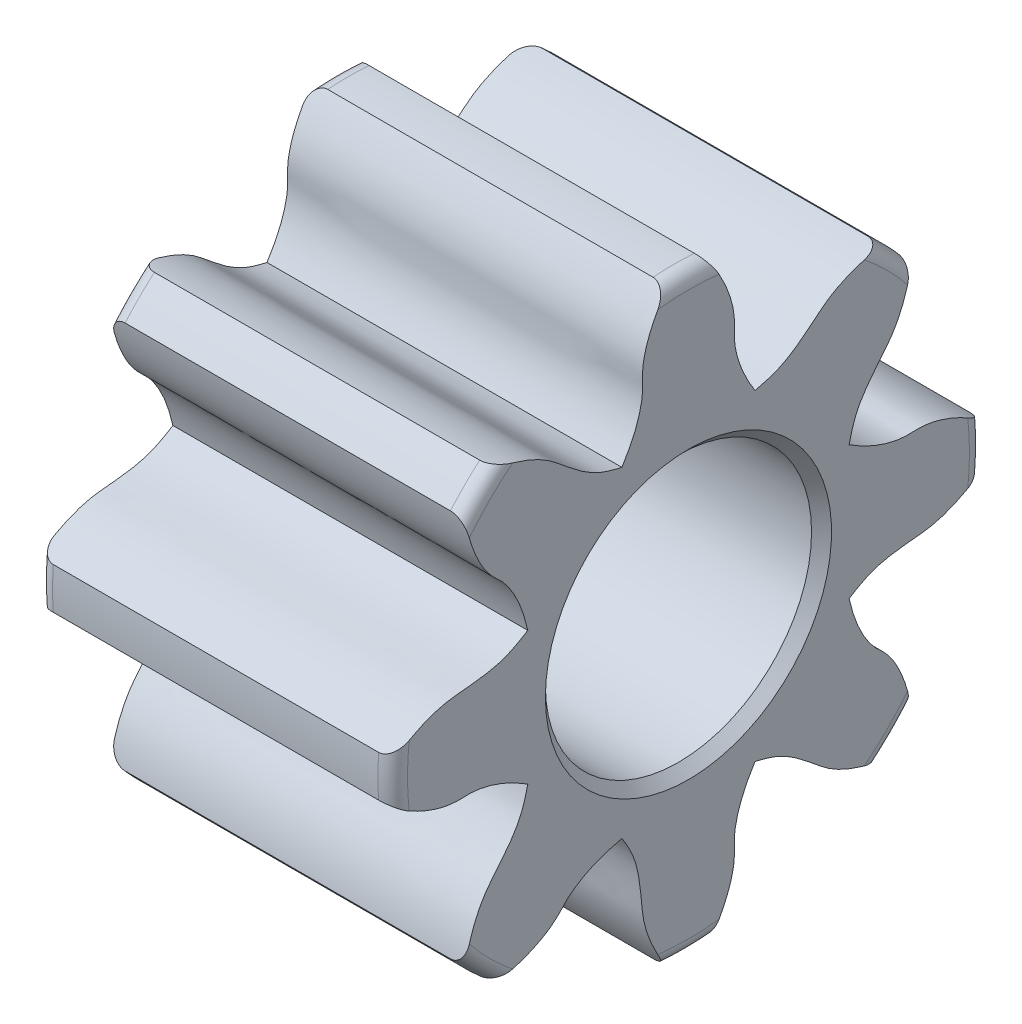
from build123d import *

# Parameters (mm, degrees)
BOSS_EXTRUDE1_DEPTH = 3.175
CUT_EXTRUDE1_DEPTH  = 5.90728996
CUT_EXTRUDE2_DEPTH  = 5.90728996
CUT_EXTRUDE3_DEPTH  = 5.90728996
CUT_EXTRUDE4_DEPTH  = 5.90728996
CUT_EXTRUDE5_DEPTH  = 5.90728996
CUT_EXTRUDE6_DEPTH  = 5.90728996
CUT_EXTRUDE7_DEPTH  = 5.90728996
HOLE1_D             = 2.38125
CHAMFER1_SIZE       = 0.089296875
CHAMFER2_SIZE       = 0.089296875
FILLET1_R           = 0.132291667
FILLET2_R           = 0.132291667
FILLET3_R           = 0.132291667
FILLET4_R           = 0.132291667
FILLET5_R           = 0.132291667
FILLET6_R           = 0.132291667
FILLET7_R           = 0.132291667
FILLET8_R           = 0.132291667
FILLET9_R           = 0.132291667
FILLET10_R          = 0.132291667
FILLET11_R          = 0.132291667
FILLET12_R          = 0.132291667
FILLET13_R          = 0.132291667
FILLET14_R          = 0.132291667
FILLET15_R          = 0.132291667
FILLET16_R          = 0.132291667


with BuildPart() as part:
    # Sketch1 → Boss-Extrude1 (new body)
    with BuildSketch(Plane(origin=(-1.5875, 0, 0), x_dir=(0, -1, 0), z_dir=(-1, 0, 0))):
        with BuildLine():
            ThreePointArc((-1.997219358, -1.735381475), (2.444431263, 1.012516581), (-2.63934736, -0.185147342))
            add(Edge.make_bspline(
                [(-1.437345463, -0.595367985), (-1.548706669, -0.524120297), (-1.670525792, -0.46427939), (-1.798706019, -0.431916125), (-1.862731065, -0.415750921), (-1.929703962, -0.406023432), (-1.99560921, -0.410148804), (-2.061508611, -0.41427381), (-2.128707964, -0.409873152), (-2.193151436, -0.39549311), (-2.300095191, -0.371629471), (-2.402834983, -0.327234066), (-2.498570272, -0.273931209), (-2.547042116, -0.246943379), (-2.594024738, -0.217143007), (-2.63934736, -0.185147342)],
                knots=[0, 0, 0, 0, 0.000396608, 0.000396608, 0.000396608, 0.000593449, 0.000593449, 0.000593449, 0.00078917, 0.00078917, 0.00078917, 0.001114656, 0.001114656, 0.001114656, 0.001278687, 0.001278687, 0.001278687, 0.001278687], degree=3))
            add(Edge.make_bspline(
                [(-1.997219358, -1.735381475), (-1.987795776, -1.68070919), (-1.97564609, -1.626415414), (-1.960454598, -1.573057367), (-1.922452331, -1.439579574), (-1.865661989, -1.306789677), (-1.779187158, -1.198242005), (-1.667988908, -1.058660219), (-1.538791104, -0.922348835), (-1.481251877, -0.753418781), (-1.46362237, -0.701660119), (-1.449076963, -0.648773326), (-1.437345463, -0.595367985)],
                knots=[-0.000164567, -0.000164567, -0.000164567, -0.000164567, 0, 0, 0, 0.000416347, 0.000416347, 0.000416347, 0.000940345, 0.000940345, 0.000940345, 0.001095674, 0.001095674, 0.001095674, 0.001095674], degree=3))
        make_face()
    extrude(amount=-BOSS_EXTRUDE1_DEPTH)

    # Sketch2 → Cut-Extrude1 (cut, through all)
    with BuildSketch(Plane(origin=(1.5875, 0, 0), x_dir=(0, 0, -1), z_dir=(1, 0, 0))):
        with BuildLine():
            ThreePointArc((2.63934736, 0.185147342), (2.444431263, 1.012516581), (1.997219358, 1.735381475))
            add(Edge.make_bspline(
                [(1.997219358, 1.735381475), (1.987795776, 1.68070919), (1.97564609, 1.626415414), (1.960454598, 1.573057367), (1.922452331, 1.439579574), (1.865661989, 1.306789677), (1.779187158, 1.198242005), (1.667988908, 1.058660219), (1.538791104, 0.922348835), (1.481251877, 0.753418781), (1.46362237, 0.701660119), (1.449076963, 0.648773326), (1.437345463, 0.595367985)],
                knots=[-0.000164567, -0.000164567, -0.000164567, -0.000164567, 0, 0, 0, 0.000416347, 0.000416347, 0.000416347, 0.000940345, 0.000940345, 0.000940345, 0.001095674, 0.001095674, 0.001095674, 0.001095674], degree=3))
            add(Edge.make_bspline(
                [(1.437345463, 0.595367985), (1.548706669, 0.524120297), (1.670525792, 0.46427939), (1.798706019, 0.431916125), (1.862731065, 0.415750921), (1.929703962, 0.406023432), (1.99560921, 0.410148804), (2.061508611, 0.41427381), (2.128707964, 0.409873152), (2.193151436, 0.39549311), (2.300095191, 0.371629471), (2.402834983, 0.327234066), (2.498570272, 0.273931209), (2.547042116, 0.246943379), (2.594024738, 0.217143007), (2.63934736, 0.185147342)],
                knots=[0, 0, 0, 0, 0.000396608, 0.000396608, 0.000396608, 0.000593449, 0.000593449, 0.000593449, 0.00078917, 0.00078917, 0.00078917, 0.001114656, 0.001114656, 0.001114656, 0.001278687, 0.001278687, 0.001278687, 0.001278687], degree=3))
        make_face()
    extrude(amount=-CUT_EXTRUDE1_DEPTH, mode=Mode.SUBTRACT)

    # Sketch3 → Cut-Extrude2 (cut, through all)
    with BuildSketch(Plane(origin=(1.5875, 0, 0), x_dir=(0, 0, -1), z_dir=(1, 0, 0))):
        with BuildLine():
            ThreePointArc((1.997219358, -1.735381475), (2.444431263, -1.012516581), (2.63934736, -0.185147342))
            add(Edge.make_bspline(
                [(2.63934736, -0.185147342), (2.594024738, -0.217143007), (2.547042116, -0.246943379), (2.498570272, -0.273931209), (2.377315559, -0.341442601), (2.243262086, -0.395182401), (2.105360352, -0.410790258), (1.928032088, -0.430860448), (1.74028874, -0.435890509), (1.580150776, -0.514655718), (1.531085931, -0.538788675), (1.483404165, -0.565900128), (1.437345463, -0.595367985)],
                knots=[-0.000164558, -0.000164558, -0.000164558, -0.000164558, 0, 0, 0, 0.000416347, 0.000416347, 0.000416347, 0.000940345, 0.000940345, 0.000940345, 0.001095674, 0.001095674, 0.001095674, 0.001095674], degree=3))
            add(Edge.make_bspline(
                [(1.437345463, -0.595367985), (1.465710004, -0.724491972), (1.509535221, -0.852945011), (1.577288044, -0.966466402), (1.611130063, -1.023169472), (1.65160868, -1.077404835), (1.701127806, -1.121089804), (1.750642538, -1.164770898), (1.795047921, -1.215399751), (1.830448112, -1.271136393), (1.889194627, -1.363631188), (1.930450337, -1.467671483), (1.960454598, -1.573057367), (1.97564609, -1.626415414), (1.987795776, -1.68070919), (1.997219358, -1.735381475)],
                knots=[0, 0, 0, 0, 0.000396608, 0.000396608, 0.000396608, 0.000593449, 0.000593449, 0.000593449, 0.00078917, 0.00078917, 0.00078917, 0.001114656, 0.001114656, 0.001114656, 0.001278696, 0.001278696, 0.001278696, 0.001278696], degree=3))
        make_face()
    extrude(amount=-CUT_EXTRUDE2_DEPTH, mode=Mode.SUBTRACT)

    # Sketch4 → Cut-Extrude3 (cut, through all)
    with BuildSketch(Plane(origin=(1.5875, 0, 0), x_dir=(0, 0, -1), z_dir=(1, 0, 0))):
        with BuildLine():
            ThreePointArc((0.185147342, -2.63934736), (1.012516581, -2.444431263), (1.735381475, -1.997219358))
            add(Edge.make_bspline(
                [(1.735381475, -1.997219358), (1.68070919, -1.987795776), (1.626415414, -1.97564609), (1.573057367, -1.960454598), (1.439579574, -1.922452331), (1.306789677, -1.865661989), (1.198242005, -1.779187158), (1.058660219, -1.667988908), (0.922348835, -1.538791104), (0.753418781, -1.481251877), (0.701660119, -1.46362237), (0.648773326, -1.449076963), (0.595367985, -1.437345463)],
                knots=[-0.000164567, -0.000164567, -0.000164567, -0.000164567, 0, 0, 0, 0.000416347, 0.000416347, 0.000416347, 0.000940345, 0.000940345, 0.000940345, 0.001095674, 0.001095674, 0.001095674, 0.001095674], degree=3))
            add(Edge.make_bspline(
                [(0.595367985, -1.437345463), (0.524120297, -1.548706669), (0.46427939, -1.670525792), (0.431916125, -1.798706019), (0.415750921, -1.862731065), (0.406023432, -1.929703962), (0.410148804, -1.99560921), (0.41427381, -2.061508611), (0.409873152, -2.128707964), (0.39549311, -2.193151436), (0.371629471, -2.300095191), (0.327234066, -2.402834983), (0.273931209, -2.498570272), (0.246943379, -2.547042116), (0.217143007, -2.594024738), (0.185147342, -2.63934736)],
                knots=[0, 0, 0, 0, 0.000396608, 0.000396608, 0.000396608, 0.000593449, 0.000593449, 0.000593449, 0.00078917, 0.00078917, 0.00078917, 0.001114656, 0.001114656, 0.001114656, 0.001278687, 0.001278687, 0.001278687, 0.001278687], degree=3))
        make_face()
    extrude(amount=-CUT_EXTRUDE3_DEPTH, mode=Mode.SUBTRACT)

    # Sketch5 → Cut-Extrude4 (cut, through all)
    with BuildSketch(Plane(origin=(1.5875, 0, 0), x_dir=(0, 0, -1), z_dir=(1, 0, 0))):
        with BuildLine():
            ThreePointArc((-1.735381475, -1.997219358), (-1.012516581, -2.444431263), (-0.185147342, -2.63934736))
            add(Edge.make_bspline(
                [(-0.185147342, -2.63934736), (-0.217143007, -2.594024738), (-0.246943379, -2.547042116), (-0.273931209, -2.498570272), (-0.341442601, -2.377315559), (-0.395182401, -2.243262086), (-0.410790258, -2.105360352), (-0.430860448, -1.928032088), (-0.435890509, -1.74028874), (-0.514655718, -1.580150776), (-0.538788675, -1.531085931), (-0.565900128, -1.483404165), (-0.595367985, -1.437345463)],
                knots=[-0.000164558, -0.000164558, -0.000164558, -0.000164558, 0, 0, 0, 0.000416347, 0.000416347, 0.000416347, 0.000940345, 0.000940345, 0.000940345, 0.001095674, 0.001095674, 0.001095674, 0.001095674], degree=3))
            add(Edge.make_bspline(
                [(-0.595367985, -1.437345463), (-0.724491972, -1.465710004), (-0.852945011, -1.509535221), (-0.966466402, -1.577288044), (-1.023169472, -1.611130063), (-1.077404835, -1.65160868), (-1.121089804, -1.701127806), (-1.164770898, -1.750642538), (-1.215399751, -1.795047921), (-1.271136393, -1.830448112), (-1.363631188, -1.889194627), (-1.467671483, -1.930450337), (-1.573057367, -1.960454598), (-1.626415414, -1.97564609), (-1.68070919, -1.987795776), (-1.735381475, -1.997219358)],
                knots=[0, 0, 0, 0, 0.000396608, 0.000396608, 0.000396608, 0.000593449, 0.000593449, 0.000593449, 0.00078917, 0.00078917, 0.00078917, 0.001114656, 0.001114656, 0.001114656, 0.001278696, 0.001278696, 0.001278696, 0.001278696], degree=3))
        make_face()
    extrude(amount=-CUT_EXTRUDE4_DEPTH, mode=Mode.SUBTRACT)

    # Sketch6 → Cut-Extrude5 (cut, through all)
    with BuildSketch(Plane(origin=(1.5875, 0, 0), x_dir=(0, 0, -1), z_dir=(1, 0, 0))):
        with BuildLine():
            ThreePointArc((-2.63934736, -0.185147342), (-2.444431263, -1.012516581), (-1.997219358, -1.735381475))
            add(Edge.make_bspline(
                [(-1.997219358, -1.735381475), (-1.987795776, -1.68070919), (-1.97564609, -1.626415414), (-1.960454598, -1.573057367), (-1.922452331, -1.439579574), (-1.865661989, -1.306789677), (-1.779187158, -1.198242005), (-1.667988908, -1.058660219), (-1.538791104, -0.922348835), (-1.481251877, -0.753418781), (-1.46362237, -0.701660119), (-1.449076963, -0.648773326), (-1.437345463, -0.595367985)],
                knots=[-0.000164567, -0.000164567, -0.000164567, -0.000164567, 0, 0, 0, 0.000416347, 0.000416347, 0.000416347, 0.000940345, 0.000940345, 0.000940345, 0.001095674, 0.001095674, 0.001095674, 0.001095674], degree=3))
            add(Edge.make_bspline(
                [(-1.437345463, -0.595367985), (-1.548706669, -0.524120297), (-1.670525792, -0.46427939), (-1.798706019, -0.431916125), (-1.862731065, -0.415750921), (-1.929703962, -0.406023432), (-1.99560921, -0.410148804), (-2.061508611, -0.41427381), (-2.128707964, -0.409873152), (-2.193151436, -0.39549311), (-2.300095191, -0.371629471), (-2.402834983, -0.327234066), (-2.498570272, -0.273931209), (-2.547042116, -0.246943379), (-2.594024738, -0.217143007), (-2.63934736, -0.185147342)],
                knots=[0, 0, 0, 0, 0.000396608, 0.000396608, 0.000396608, 0.000593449, 0.000593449, 0.000593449, 0.00078917, 0.00078917, 0.00078917, 0.001114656, 0.001114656, 0.001114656, 0.001278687, 0.001278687, 0.001278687, 0.001278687], degree=3))
        make_face()
    extrude(amount=-CUT_EXTRUDE5_DEPTH, mode=Mode.SUBTRACT)

    # Sketch7 → Cut-Extrude6 (cut, through all)
    with BuildSketch(Plane(origin=(1.5875, 0, 0), x_dir=(0, 0, -1), z_dir=(1, 0, 0))):
        with BuildLine():
            ThreePointArc((-1.997219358, 1.735381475), (-2.444431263, 1.012516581), (-2.63934736, 0.185147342))
            add(Edge.make_bspline(
                [(-2.63934736, 0.185147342), (-2.594024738, 0.217143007), (-2.547042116, 0.246943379), (-2.498570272, 0.273931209), (-2.377315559, 0.341442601), (-2.243262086, 0.395182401), (-2.105360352, 0.410790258), (-1.928032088, 0.430860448), (-1.74028874, 0.435890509), (-1.580150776, 0.514655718), (-1.531085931, 0.538788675), (-1.483404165, 0.565900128), (-1.437345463, 0.595367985)],
                knots=[-0.000164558, -0.000164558, -0.000164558, -0.000164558, 0, 0, 0, 0.000416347, 0.000416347, 0.000416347, 0.000940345, 0.000940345, 0.000940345, 0.001095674, 0.001095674, 0.001095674, 0.001095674], degree=3))
            add(Edge.make_bspline(
                [(-1.437345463, 0.595367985), (-1.465710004, 0.724491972), (-1.509535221, 0.852945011), (-1.577288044, 0.966466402), (-1.611130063, 1.023169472), (-1.65160868, 1.077404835), (-1.701127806, 1.121089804), (-1.750642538, 1.164770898), (-1.795047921, 1.215399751), (-1.830448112, 1.271136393), (-1.889194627, 1.363631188), (-1.930450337, 1.467671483), (-1.960454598, 1.573057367), (-1.97564609, 1.626415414), (-1.987795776, 1.68070919), (-1.997219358, 1.735381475)],
                knots=[0, 0, 0, 0, 0.000396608, 0.000396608, 0.000396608, 0.000593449, 0.000593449, 0.000593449, 0.00078917, 0.00078917, 0.00078917, 0.001114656, 0.001114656, 0.001114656, 0.001278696, 0.001278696, 0.001278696, 0.001278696], degree=3))
        make_face()
    extrude(amount=-CUT_EXTRUDE6_DEPTH, mode=Mode.SUBTRACT)

    # Sketch8 → Cut-Extrude7 (cut, through all)
    with BuildSketch(Plane(origin=(1.5875, 0, 0), x_dir=(0, 0, -1), z_dir=(1, 0, 0))):
        with BuildLine():
            ThreePointArc((-0.185147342, 2.63934736), (-1.012516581, 2.444431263), (-1.735381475, 1.997219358))
            add(Edge.make_bspline(
                [(-1.735381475, 1.997219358), (-1.68070919, 1.987795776), (-1.626415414, 1.97564609), (-1.573057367, 1.960454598), (-1.439579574, 1.922452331), (-1.306789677, 1.865661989), (-1.198242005, 1.779187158), (-1.058660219, 1.667988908), (-0.922348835, 1.538791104), (-0.753418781, 1.481251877), (-0.701660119, 1.46362237), (-0.648773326, 1.449076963), (-0.595367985, 1.437345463)],
                knots=[-0.000164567, -0.000164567, -0.000164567, -0.000164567, 0, 0, 0, 0.000416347, 0.000416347, 0.000416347, 0.000940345, 0.000940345, 0.000940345, 0.001095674, 0.001095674, 0.001095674, 0.001095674], degree=3))
            add(Edge.make_bspline(
                [(-0.595367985, 1.437345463), (-0.524120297, 1.548706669), (-0.46427939, 1.670525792), (-0.431916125, 1.798706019), (-0.415750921, 1.862731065), (-0.406023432, 1.929703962), (-0.410148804, 1.99560921), (-0.41427381, 2.061508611), (-0.409873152, 2.128707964), (-0.39549311, 2.193151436), (-0.371629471, 2.300095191), (-0.327234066, 2.402834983), (-0.273931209, 2.498570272), (-0.246943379, 2.547042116), (-0.217143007, 2.594024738), (-0.185147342, 2.63934736)],
                knots=[0, 0, 0, 0, 0.000396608, 0.000396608, 0.000396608, 0.000593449, 0.000593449, 0.000593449, 0.00078917, 0.00078917, 0.00078917, 0.001114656, 0.001114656, 0.001114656, 0.001278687, 0.001278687, 0.001278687, 0.001278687], degree=3))
        make_face()
    extrude(amount=-CUT_EXTRUDE7_DEPTH, mode=Mode.SUBTRACT)

    # Hole1 (through all)
    with Locations(Plane.ZY.offset(1.5875)):
        with Locations((0, 0)):
            Hole(HOLE1_D / 2)

    # Chamfer1
    chamfer1_edges = [part.edges().sort_by_distance(p)[0] for p in [
        (-1.5875, 0, 1.190625),
    ]]
    chamfer(chamfer1_edges, length=CHAMFER1_SIZE)

    # Chamfer2
    chamfer2_edges = [part.edges().sort_by_distance(p)[0] for p in [
        (1.5875, 0, 1.190625),
    ]]
    chamfer(chamfer2_edges, length=CHAMFER2_SIZE)

    # Fillet1
    fillet1_edges = [part.edges().sort_by_distance(p)[0] for p in [
        (-1.5875, 0, -2.645833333),
    ]]
    fillet(fillet1_edges, radius=FILLET1_R)

    # Fillet2
    fillet2_edges = [part.edges().sort_by_distance(p)[0] for p in [
        (-1.5875, 1.870886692, -1.870886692),
    ]]
    fillet(fillet2_edges, radius=FILLET2_R)

    # Fillet3
    fillet3_edges = [part.edges().sort_by_distance(p)[0] for p in [
        (-1.5875, -1.870886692, -1.870886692),
    ]]
    fillet(fillet3_edges, radius=FILLET3_R)

    # Fillet4
    fillet4_edges = [part.edges().sort_by_distance(p)[0] for p in [
        (1.5875, 1.870886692, -1.870886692),
    ]]
    fillet(fillet4_edges, radius=FILLET4_R)

    # Fillet5
    fillet5_edges = [part.edges().sort_by_distance(p)[0] for p in [
        (-1.5875, -2.645833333, 0),
    ]]
    fillet(fillet5_edges, radius=FILLET5_R)

    # Fillet6
    fillet6_edges = [part.edges().sort_by_distance(p)[0] for p in [
        (1.5875, -1.870886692, -1.870886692),
    ]]
    fillet(fillet6_edges, radius=FILLET6_R)

    # Fillet7
    fillet7_edges = [part.edges().sort_by_distance(p)[0] for p in [
        (-1.5875, -1.870886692, 1.870886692),
    ]]
    fillet(fillet7_edges, radius=FILLET7_R)

    # Fillet8
    fillet8_edges = [part.edges().sort_by_distance(p)[0] for p in [
        (1.5875, -1.870886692, 1.870886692),
    ]]
    fillet(fillet8_edges, radius=FILLET8_R)

    # Fillet9
    fillet9_edges = [part.edges().sort_by_distance(p)[0] for p in [
        (-1.5875, 0, 2.645833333),
    ]]
    fillet(fillet9_edges, radius=FILLET9_R)

    # Fillet10
    fillet10_edges = [part.edges().sort_by_distance(p)[0] for p in [
        (1.5875, 1.870886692, 1.870886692),
    ]]
    fillet(fillet10_edges, radius=FILLET10_R)

    # Fillet11
    fillet11_edges = [part.edges().sort_by_distance(p)[0] for p in [
        (-1.5875, 1.870886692, 1.870886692),
    ]]
    fillet(fillet11_edges, radius=FILLET11_R)

    # Fillet12
    fillet12_edges = [part.edges().sort_by_distance(p)[0] for p in [
        (1.5875, 0, -2.645833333),
    ]]
    fillet(fillet12_edges, radius=FILLET12_R)

    # Fillet13
    fillet13_edges = [part.edges().sort_by_distance(p)[0] for p in [
        (-1.5875, 2.645833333, 0),
    ]]
    fillet(fillet13_edges, radius=FILLET13_R)

    # Fillet14
    fillet14_edges = [part.edges().sort_by_distance(p)[0] for p in [
        (1.5875, 0, 2.645833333),
    ]]
    fillet(fillet14_edges, radius=FILLET14_R)

    # Fillet15
    fillet15_edges = [part.edges().sort_by_distance(p)[0] for p in [
        (1.5875, -2.645833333, 0),
    ]]
    fillet(fillet15_edges, radius=FILLET15_R)

    # Fillet16
    fillet16_edges = [part.edges().sort_by_distance(p)[0] for p in [
        (1.5875, 2.645833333, 0),
    ]]
    fillet(fillet16_edges, radius=FILLET16_R)


solid = part.part
